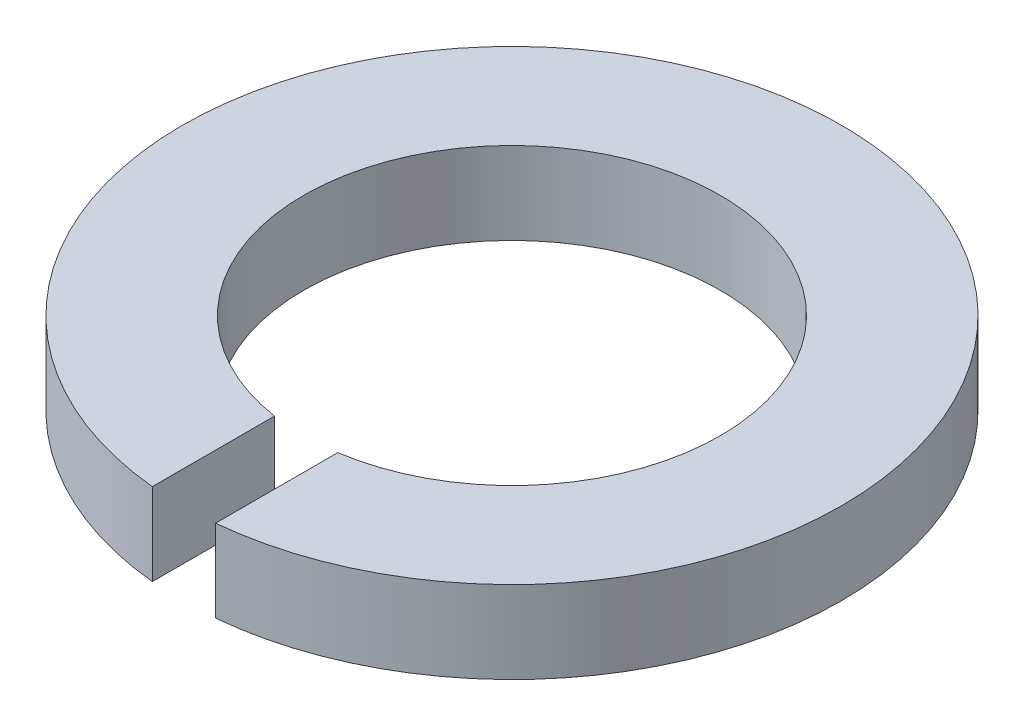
ISO-10303-21;
HEADER;
FILE_DESCRIPTION(('STEP AP214'),'2;1');
FILE_NAME('part.step','',(''),(''),'','','');
FILE_SCHEMA(('AUTOMOTIVE_DESIGN { 1 0 10303 214 1 1 1 1 }'));
ENDSEC;
DATA;
#1=APPLICATION_CONTEXT('core data for automotive mechanical design processes');
#2=APPLICATION_PROTOCOL_DEFINITION('international standard','automotive_design',2000,#1);
#3=PRODUCT_CONTEXT('',#1,'mechanical');
#4=PRODUCT('Part','Part','',(#3));
#5=PRODUCT_RELATED_PRODUCT_CATEGORY('part','',(#4));
#6=PRODUCT_DEFINITION_FORMATION('','',#4);
#7=PRODUCT_DEFINITION_CONTEXT('part definition',#1,'design');
#8=PRODUCT_DEFINITION('design','',#6,#7);
#9=PRODUCT_DEFINITION_SHAPE('','',#8);
#10=(LENGTH_UNIT() NAMED_UNIT(*) SI_UNIT(.MILLI.,.METRE.));
#11=(NAMED_UNIT(*) PLANE_ANGLE_UNIT() SI_UNIT($,.RADIAN.));
#12=(NAMED_UNIT(*) SI_UNIT($,.STERADIAN.) SOLID_ANGLE_UNIT());
#13=UNCERTAINTY_MEASURE_WITH_UNIT(LENGTH_MEASURE(1.E-05),#10,'distance_accuracy_value','');
#14=(GEOMETRIC_REPRESENTATION_CONTEXT(3) GLOBAL_UNCERTAINTY_ASSIGNED_CONTEXT((#13)) GLOBAL_UNIT_ASSIGNED_CONTEXT((#10,
#11,#12)) REPRESENTATION_CONTEXT('',''));
#15=CARTESIAN_POINT('',(0.,0.,0.));
#16=DIRECTION('',(0.,0.,1.));
#17=DIRECTION('',(1.,0.,0.));
#18=AXIS2_PLACEMENT_3D('',#15,#16,#17);
#19=CARTESIAN_POINT('',(0.,3.9624,0.));
#20=DIRECTION('',(0.,1.,0.));
#21=DIRECTION('',(0.,0.,1.));
#22=AXIS2_PLACEMENT_3D('',#19,#20,#21);
#23=PLANE('',#22);
#24=DIRECTION('',(0.,0.,-1.));
#25=VECTOR('',#24,1.);
#26=CARTESIAN_POINT('',(1.524,3.9624,0.));
#27=LINE('',#26,#25);
#28=CARTESIAN_POINT('',(1.524,3.9624,15.801678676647));
#29=VERTEX_POINT('',#28);
#30=CARTESIAN_POINT('',(1.524,3.9624,9.91657768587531));
#31=VERTEX_POINT('',#30);
#32=EDGE_CURVE('E48',#29,#31,#27,.T.);
#33=ORIENTED_EDGE('',*,*,#32,.F.);
#34=CARTESIAN_POINT('',(0.,3.9624,0.));
#35=DIRECTION('',(0.,1.,0.));
#36=DIRECTION('',(0.,0.,1.));
#37=AXIS2_PLACEMENT_3D('',#34,#35,#36);
#38=CIRCLE('',#37,15.875);
#39=CARTESIAN_POINT('',(-1.524,3.9624,15.801678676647));
#40=VERTEX_POINT('',#39);
#41=EDGE_CURVE('E79',#29,#40,#38,.T.);
#42=ORIENTED_EDGE('',*,*,#41,.T.);
#43=DIRECTION('',(0.,0.,1.));
#44=VECTOR('',#43,1.);
#45=CARTESIAN_POINT('',(-1.524,3.9624,0.));
#46=LINE('',#45,#44);
#47=CARTESIAN_POINT('',(-1.524,3.9624,9.9165776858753));
#48=VERTEX_POINT('',#47);
#49=EDGE_CURVE('E82',#48,#40,#46,.T.);
#50=ORIENTED_EDGE('',*,*,#49,.F.);
#51=CARTESIAN_POINT('',(0.,3.9624,0.));
#52=DIRECTION('',(0.,1.,0.));
#53=DIRECTION('',(0.,0.,1.));
#54=AXIS2_PLACEMENT_3D('',#51,#52,#53);
#55=CIRCLE('',#54,10.033);
#56=EDGE_CURVE('E81',#31,#48,#55,.T.);
#57=ORIENTED_EDGE('',*,*,#56,.F.);
#58=EDGE_LOOP('',(#33,#42,#50,#57));
#59=FACE_BOUND('',#58,.T.);
#60=ADVANCED_FACE('F26',(#59),#23,.T.);
#61=CARTESIAN_POINT('',(0.,0.,0.));
#62=DIRECTION('',(0.,1.,0.));
#63=DIRECTION('',(0.,0.,1.));
#64=AXIS2_PLACEMENT_3D('',#61,#62,#63);
#65=PLANE('',#64);
#66=CARTESIAN_POINT('',(0.,0.,0.));
#67=DIRECTION('',(0.,1.,0.));
#68=DIRECTION('',(0.,0.,1.));
#69=AXIS2_PLACEMENT_3D('',#66,#67,#68);
#70=CIRCLE('',#69,15.875);
#71=CARTESIAN_POINT('',(1.524,0.,15.801678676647));
#72=VERTEX_POINT('',#71);
#73=CARTESIAN_POINT('',(-1.524,0.,15.801678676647));
#74=VERTEX_POINT('',#73);
#75=EDGE_CURVE('E85',#72,#74,#70,.T.);
#76=ORIENTED_EDGE('',*,*,#75,.F.);
#77=DIRECTION('',(0.,0.,-1.));
#78=VECTOR('',#77,1.);
#79=CARTESIAN_POINT('',(1.524,0.,0.));
#80=LINE('',#79,#78);
#81=CARTESIAN_POINT('',(1.524,0.,9.9165776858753));
#82=VERTEX_POINT('',#81);
#83=EDGE_CURVE('E67',#72,#82,#80,.T.);
#84=ORIENTED_EDGE('',*,*,#83,.T.);
#85=CARTESIAN_POINT('',(0.,0.,0.));
#86=DIRECTION('',(0.,1.,0.));
#87=DIRECTION('',(0.,0.,1.));
#88=AXIS2_PLACEMENT_3D('',#85,#86,#87);
#89=CIRCLE('',#88,10.033);
#90=CARTESIAN_POINT('',(-1.524,0.,9.9165776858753));
#91=VERTEX_POINT('',#90);
#92=EDGE_CURVE('E72',#82,#91,#89,.T.);
#93=ORIENTED_EDGE('',*,*,#92,.T.);
#94=DIRECTION('',(0.,0.,1.));
#95=VECTOR('',#94,1.);
#96=CARTESIAN_POINT('',(-1.524,0.,0.));
#97=LINE('',#96,#95);
#98=EDGE_CURVE('E41',#91,#74,#97,.T.);
#99=ORIENTED_EDGE('',*,*,#98,.T.);
#100=EDGE_LOOP('',(#76,#84,#93,#99));
#101=FACE_BOUND('',#100,.T.);
#102=ADVANCED_FACE('F100',(#101),#65,.F.);
#103=CARTESIAN_POINT('',(0.,3.9624,0.));
#104=DIRECTION('',(0.,-1.,0.));
#105=DIRECTION('',(0.,0.,-1.));
#106=AXIS2_PLACEMENT_3D('',#103,#104,#105);
#107=CYLINDRICAL_SURFACE('',#106,15.875);
#108=ORIENTED_EDGE('',*,*,#41,.F.);
#109=DIRECTION('',(0.,-1.,0.));
#110=VECTOR('',#109,1.);
#111=CARTESIAN_POINT('',(1.524,3.9624,15.801678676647));
#112=LINE('',#111,#110);
#113=EDGE_CURVE('E64',#29,#72,#112,.T.);
#114=ORIENTED_EDGE('',*,*,#113,.T.);
#115=ORIENTED_EDGE('',*,*,#75,.T.);
#116=DIRECTION('',(0.,-1.,0.));
#117=VECTOR('',#116,1.);
#118=CARTESIAN_POINT('',(-1.524,3.9624,15.801678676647));
#119=LINE('',#118,#117);
#120=EDGE_CURVE('E73',#74,#40,#119,.F.);
#121=ORIENTED_EDGE('',*,*,#120,.T.);
#122=EDGE_LOOP('',(#108,#114,#115,#121));
#123=FACE_BOUND('',#122,.T.);
#124=ADVANCED_FACE('F28',(#123),#107,.T.);
#125=CARTESIAN_POINT('',(0.,3.9624,0.));
#126=DIRECTION('',(0.,-1.,0.));
#127=DIRECTION('',(0.,0.,-1.));
#128=AXIS2_PLACEMENT_3D('',#125,#126,#127);
#129=CYLINDRICAL_SURFACE('',#128,10.033);
#130=DIRECTION('',(0.,-1.,0.));
#131=VECTOR('',#130,1.);
#132=CARTESIAN_POINT('',(1.524,3.9624,9.9165776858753));
#133=LINE('',#132,#131);
#134=EDGE_CURVE('E11',#31,#82,#133,.T.);
#135=ORIENTED_EDGE('',*,*,#134,.F.);
#136=ORIENTED_EDGE('',*,*,#56,.T.);
#137=DIRECTION('',(0.,-1.,0.));
#138=VECTOR('',#137,1.);
#139=CARTESIAN_POINT('',(-1.524,3.9624,9.9165776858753));
#140=LINE('',#139,#138);
#141=EDGE_CURVE('E34',#91,#48,#140,.F.);
#142=ORIENTED_EDGE('',*,*,#141,.F.);
#143=ORIENTED_EDGE('',*,*,#92,.F.);
#144=EDGE_LOOP('',(#135,#136,#142,#143));
#145=FACE_BOUND('',#144,.T.);
#146=ADVANCED_FACE('F97',(#145),#129,.F.);
#147=CARTESIAN_POINT('',(-1.524,0.,0.));
#148=DIRECTION('',(-1.,0.,0.));
#149=DIRECTION('',(0.,0.,1.));
#150=AXIS2_PLACEMENT_3D('',#147,#148,#149);
#151=PLANE('',#150);
#152=ORIENTED_EDGE('',*,*,#98,.F.);
#153=ORIENTED_EDGE('',*,*,#141,.T.);
#154=ORIENTED_EDGE('',*,*,#49,.T.);
#155=ORIENTED_EDGE('',*,*,#120,.F.);
#156=EDGE_LOOP('',(#152,#153,#154,#155));
#157=FACE_BOUND('',#156,.T.);
#158=ADVANCED_FACE('F95',(#157),#151,.F.);
#159=CARTESIAN_POINT('',(1.524,0.,0.));
#160=DIRECTION('',(1.,0.,0.));
#161=DIRECTION('',(0.,0.,-1.));
#162=AXIS2_PLACEMENT_3D('',#159,#160,#161);
#163=PLANE('',#162);
#164=ORIENTED_EDGE('',*,*,#32,.T.);
#165=ORIENTED_EDGE('',*,*,#134,.T.);
#166=ORIENTED_EDGE('',*,*,#83,.F.);
#167=ORIENTED_EDGE('',*,*,#113,.F.);
#168=EDGE_LOOP('',(#164,#165,#166,#167));
#169=FACE_BOUND('',#168,.T.);
#170=ADVANCED_FACE('F65',(#169),#163,.F.);
#171=CLOSED_SHELL('',(#60,#102,#124,#146,#158,#170));
#172=MANIFOLD_SOLID_BREP('B2',#171);
#173=ADVANCED_BREP_SHAPE_REPRESENTATION('',(#18,#172),#14);
#174=SHAPE_DEFINITION_REPRESENTATION(#9,#173);
ENDSEC;
END-ISO-10303-21;
